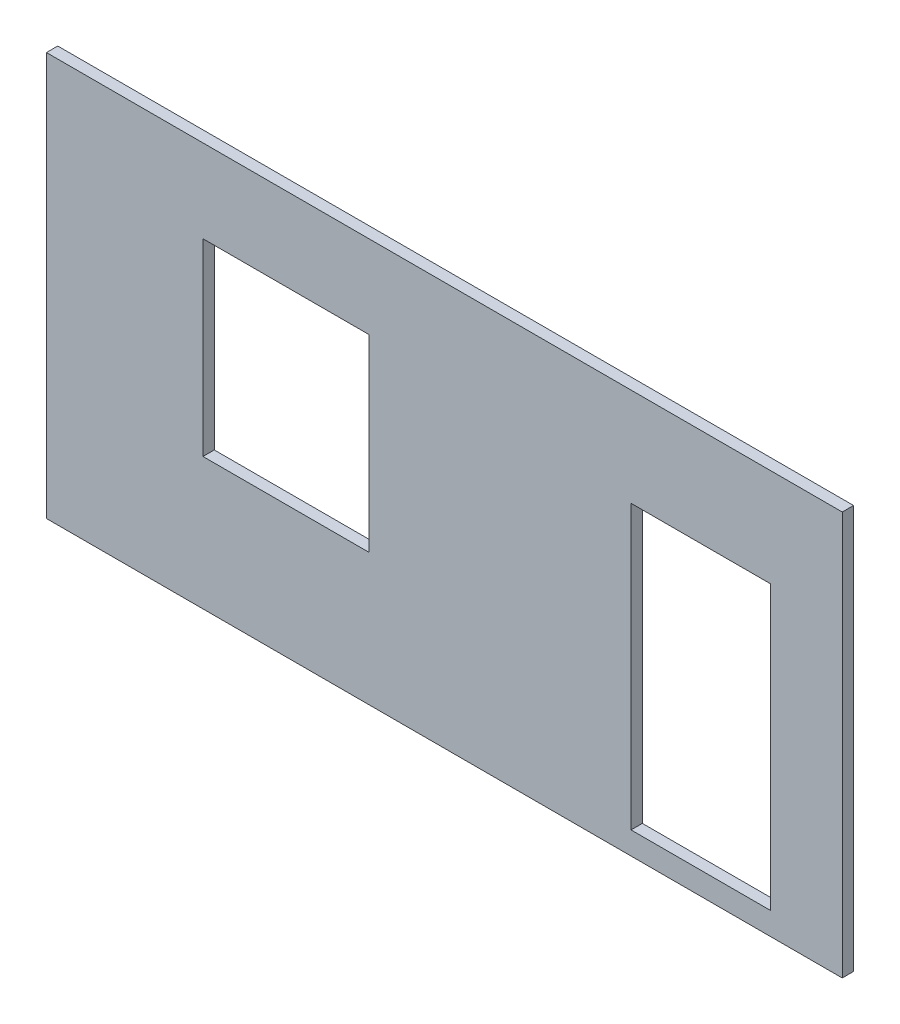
ISO-10303-21;
HEADER;
FILE_DESCRIPTION(('STEP AP214'),'2;1');
FILE_NAME('part.step','',(''),(''),'','','');
FILE_SCHEMA(('AUTOMOTIVE_DESIGN { 1 0 10303 214 1 1 1 1 }'));
ENDSEC;
DATA;
#1=APPLICATION_CONTEXT('core data for automotive mechanical design processes');
#2=APPLICATION_PROTOCOL_DEFINITION('international standard','automotive_design',2000,#1);
#3=PRODUCT_CONTEXT('',#1,'mechanical');
#4=PRODUCT('Part','Part','',(#3));
#5=PRODUCT_RELATED_PRODUCT_CATEGORY('part','',(#4));
#6=PRODUCT_DEFINITION_FORMATION('','',#4);
#7=PRODUCT_DEFINITION_CONTEXT('part definition',#1,'design');
#8=PRODUCT_DEFINITION('design','',#6,#7);
#9=PRODUCT_DEFINITION_SHAPE('','',#8);
#10=(LENGTH_UNIT() NAMED_UNIT(*) SI_UNIT(.MILLI.,.METRE.));
#11=(NAMED_UNIT(*) PLANE_ANGLE_UNIT() SI_UNIT($,.RADIAN.));
#12=(NAMED_UNIT(*) SI_UNIT($,.STERADIAN.) SOLID_ANGLE_UNIT());
#13=UNCERTAINTY_MEASURE_WITH_UNIT(LENGTH_MEASURE(1.E-05),#10,'distance_accuracy_value','');
#14=(GEOMETRIC_REPRESENTATION_CONTEXT(3) GLOBAL_UNCERTAINTY_ASSIGNED_CONTEXT((#13)) GLOBAL_UNIT_ASSIGNED_CONTEXT((#10,
#11,#12)) REPRESENTATION_CONTEXT('',''));
#15=CARTESIAN_POINT('',(0.,0.,0.));
#16=DIRECTION('',(0.,0.,1.));
#17=DIRECTION('',(1.,0.,0.));
#18=AXIS2_PLACEMENT_3D('',#15,#16,#17);
#19=CARTESIAN_POINT('',(0.,0.,3.));
#20=DIRECTION('',(1.,0.,0.));
#21=DIRECTION('',(0.,0.,-1.));
#22=AXIS2_PLACEMENT_3D('',#19,#20,#21);
#23=PLANE('',#22);
#24=DIRECTION('',(0.,-1.,0.));
#25=VECTOR('',#24,1.);
#26=CARTESIAN_POINT('',(0.,0.,0.));
#27=LINE('',#26,#25);
#28=CARTESIAN_POINT('',(0.,107.,0.));
#29=VERTEX_POINT('',#28);
#30=CARTESIAN_POINT('',(0.,0.,0.));
#31=VERTEX_POINT('',#30);
#32=EDGE_CURVE('E181',#29,#31,#27,.T.);
#33=ORIENTED_EDGE('',*,*,#32,.T.);
#34=DIRECTION('',(0.,0.,-1.));
#35=VECTOR('',#34,1.);
#36=CARTESIAN_POINT('',(0.,0.,3.));
#37=LINE('',#36,#35);
#38=CARTESIAN_POINT('',(0.,0.,3.));
#39=VERTEX_POINT('',#38);
#40=EDGE_CURVE('E11',#39,#31,#37,.T.);
#41=ORIENTED_EDGE('',*,*,#40,.F.);
#42=DIRECTION('',(0.,-1.,0.));
#43=VECTOR('',#42,1.);
#44=CARTESIAN_POINT('',(0.,0.,3.));
#45=LINE('',#44,#43);
#46=CARTESIAN_POINT('',(0.,107.,3.));
#47=VERTEX_POINT('',#46);
#48=EDGE_CURVE('E188',#47,#39,#45,.T.);
#49=ORIENTED_EDGE('',*,*,#48,.F.);
#50=DIRECTION('',(0.,0.,-1.));
#51=VECTOR('',#50,1.);
#52=CARTESIAN_POINT('',(0.,107.,3.));
#53=LINE('',#52,#51);
#54=EDGE_CURVE('E198',#47,#29,#53,.T.);
#55=ORIENTED_EDGE('',*,*,#54,.T.);
#56=EDGE_LOOP('',(#33,#41,#49,#55));
#57=FACE_BOUND('',#56,.T.);
#58=ADVANCED_FACE('F31',(#57),#23,.F.);
#59=CARTESIAN_POINT('',(0.,0.,3.));
#60=DIRECTION('',(0.,1.,0.));
#61=DIRECTION('',(0.,0.,1.));
#62=AXIS2_PLACEMENT_3D('',#59,#60,#61);
#63=PLANE('',#62);
#64=DIRECTION('',(1.,0.,0.));
#65=VECTOR('',#64,1.);
#66=CARTESIAN_POINT('',(0.,0.,0.));
#67=LINE('',#66,#65);
#68=CARTESIAN_POINT('',(211.,0.,0.));
#69=VERTEX_POINT('',#68);
#70=EDGE_CURVE('E201',#31,#69,#67,.T.);
#71=ORIENTED_EDGE('',*,*,#70,.T.);
#72=DIRECTION('',(0.,0.,-1.));
#73=VECTOR('',#72,1.);
#74=CARTESIAN_POINT('',(211.,0.,3.));
#75=LINE('',#74,#73);
#76=CARTESIAN_POINT('',(211.,0.,3.));
#77=VERTEX_POINT('',#76);
#78=EDGE_CURVE('E38',#77,#69,#75,.T.);
#79=ORIENTED_EDGE('',*,*,#78,.F.);
#80=DIRECTION('',(1.,0.,0.));
#81=VECTOR('',#80,1.);
#82=CARTESIAN_POINT('',(0.,0.,3.));
#83=LINE('',#82,#81);
#84=EDGE_CURVE('E191',#39,#77,#83,.T.);
#85=ORIENTED_EDGE('',*,*,#84,.F.);
#86=ORIENTED_EDGE('',*,*,#40,.T.);
#87=EDGE_LOOP('',(#71,#79,#85,#86));
#88=FACE_BOUND('',#87,.T.);
#89=ADVANCED_FACE('F230',(#88),#63,.F.);
#90=CARTESIAN_POINT('',(211.,0.,3.));
#91=DIRECTION('',(-1.,0.,0.));
#92=DIRECTION('',(0.,0.,1.));
#93=AXIS2_PLACEMENT_3D('',#90,#91,#92);
#94=PLANE('',#93);
#95=DIRECTION('',(0.,1.,0.));
#96=VECTOR('',#95,1.);
#97=CARTESIAN_POINT('',(211.,0.,0.));
#98=LINE('',#97,#96);
#99=CARTESIAN_POINT('',(211.,107.,0.));
#100=VERTEX_POINT('',#99);
#101=EDGE_CURVE('E203',#69,#100,#98,.T.);
#102=ORIENTED_EDGE('',*,*,#101,.T.);
#103=DIRECTION('',(0.,0.,-1.));
#104=VECTOR('',#103,1.);
#105=CARTESIAN_POINT('',(211.,107.,3.));
#106=LINE('',#105,#104);
#107=CARTESIAN_POINT('',(211.,107.,3.));
#108=VERTEX_POINT('',#107);
#109=EDGE_CURVE('E208',#108,#100,#106,.T.);
#110=ORIENTED_EDGE('',*,*,#109,.F.);
#111=DIRECTION('',(0.,1.,0.));
#112=VECTOR('',#111,1.);
#113=CARTESIAN_POINT('',(211.,0.,3.));
#114=LINE('',#113,#112);
#115=EDGE_CURVE('E194',#77,#108,#114,.T.);
#116=ORIENTED_EDGE('',*,*,#115,.F.);
#117=ORIENTED_EDGE('',*,*,#78,.T.);
#118=EDGE_LOOP('',(#102,#110,#116,#117));
#119=FACE_BOUND('',#118,.T.);
#120=ADVANCED_FACE('F215',(#119),#94,.F.);
#121=CARTESIAN_POINT('',(0.,107.,3.));
#122=DIRECTION('',(0.,-1.,0.));
#123=DIRECTION('',(0.,0.,-1.));
#124=AXIS2_PLACEMENT_3D('',#121,#122,#123);
#125=PLANE('',#124);
#126=DIRECTION('',(-1.,0.,0.));
#127=VECTOR('',#126,1.);
#128=CARTESIAN_POINT('',(0.,107.,0.));
#129=LINE('',#128,#127);
#130=EDGE_CURVE('E192',#100,#29,#129,.T.);
#131=ORIENTED_EDGE('',*,*,#130,.T.);
#132=ORIENTED_EDGE('',*,*,#54,.F.);
#133=DIRECTION('',(-1.,0.,0.));
#134=VECTOR('',#133,1.);
#135=CARTESIAN_POINT('',(0.,107.,3.));
#136=LINE('',#135,#134);
#137=EDGE_CURVE('E196',#108,#47,#136,.T.);
#138=ORIENTED_EDGE('',*,*,#137,.F.);
#139=ORIENTED_EDGE('',*,*,#109,.T.);
#140=EDGE_LOOP('',(#131,#132,#138,#139));
#141=FACE_BOUND('',#140,.T.);
#142=ADVANCED_FACE('F223',(#141),#125,.F.);
#143=CARTESIAN_POINT('',(0.,107.,3.));
#144=DIRECTION('',(0.,0.,-1.));
#145=DIRECTION('',(-1.,0.,0.));
#146=AXIS2_PLACEMENT_3D('',#143,#144,#145);
#147=PLANE('',#146);
#148=DIRECTION('',(1.,0.,0.));
#149=VECTOR('',#148,1.);
#150=CARTESIAN_POINT('',(155.,6.,3.));
#151=LINE('',#150,#149);
#152=CARTESIAN_POINT('',(155.,6.00000000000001,3.));
#153=VERTEX_POINT('',#152);
#154=CARTESIAN_POINT('',(192.,6.,3.));
#155=VERTEX_POINT('',#154);
#156=EDGE_CURVE('E146',#153,#155,#151,.T.);
#157=ORIENTED_EDGE('',*,*,#156,.F.);
#158=DIRECTION('',(0.,-1.,0.));
#159=VECTOR('',#158,1.);
#160=CARTESIAN_POINT('',(155.,6.,3.));
#161=LINE('',#160,#159);
#162=CARTESIAN_POINT('',(155.,81.,3.));
#163=VERTEX_POINT('',#162);
#164=EDGE_CURVE('E45',#163,#153,#161,.T.);
#165=ORIENTED_EDGE('',*,*,#164,.F.);
#166=DIRECTION('',(-1.,0.,0.));
#167=VECTOR('',#166,1.);
#168=CARTESIAN_POINT('',(155.,81.,3.));
#169=LINE('',#168,#167);
#170=CARTESIAN_POINT('',(192.,81.,3.));
#171=VERTEX_POINT('',#170);
#172=EDGE_CURVE('E137',#171,#163,#169,.T.);
#173=ORIENTED_EDGE('',*,*,#172,.F.);
#174=DIRECTION('',(0.,1.,0.));
#175=VECTOR('',#174,1.);
#176=CARTESIAN_POINT('',(192.,6.,3.));
#177=LINE('',#176,#175);
#178=EDGE_CURVE('E140',#155,#171,#177,.T.);
#179=ORIENTED_EDGE('',*,*,#178,.F.);
#180=EDGE_LOOP('',(#157,#165,#173,#179));
#181=FACE_BOUND('',#180,.T.);
#182=DIRECTION('',(1.,0.,0.));
#183=VECTOR('',#182,1.);
#184=CARTESIAN_POINT('',(41.5,35.,3.));
#185=LINE('',#184,#183);
#186=CARTESIAN_POINT('',(41.5,35.,3.));
#187=VERTEX_POINT('',#186);
#188=CARTESIAN_POINT('',(85.5,35.,3.));
#189=VERTEX_POINT('',#188);
#190=EDGE_CURVE('E171',#187,#189,#185,.T.);
#191=ORIENTED_EDGE('',*,*,#190,.F.);
#192=DIRECTION('',(0.,-1.,0.));
#193=VECTOR('',#192,1.);
#194=CARTESIAN_POINT('',(41.5,35.,3.));
#195=LINE('',#194,#193);
#196=CARTESIAN_POINT('',(41.5,85.,3.));
#197=VERTEX_POINT('',#196);
#198=EDGE_CURVE('E152',#197,#187,#195,.T.);
#199=ORIENTED_EDGE('',*,*,#198,.F.);
#200=DIRECTION('',(-1.,0.,0.));
#201=VECTOR('',#200,1.);
#202=CARTESIAN_POINT('',(41.5,85.,3.));
#203=LINE('',#202,#201);
#204=CARTESIAN_POINT('',(85.5,85.,3.));
#205=VERTEX_POINT('',#204);
#206=EDGE_CURVE('E160',#205,#197,#203,.T.);
#207=ORIENTED_EDGE('',*,*,#206,.F.);
#208=DIRECTION('',(0.,1.,0.));
#209=VECTOR('',#208,1.);
#210=CARTESIAN_POINT('',(85.5,35.,3.));
#211=LINE('',#210,#209);
#212=EDGE_CURVE('E174',#189,#205,#211,.T.);
#213=ORIENTED_EDGE('',*,*,#212,.F.);
#214=EDGE_LOOP('',(#191,#199,#207,#213));
#215=FACE_BOUND('',#214,.T.);
#216=ORIENTED_EDGE('',*,*,#48,.T.);
#217=ORIENTED_EDGE('',*,*,#84,.T.);
#218=ORIENTED_EDGE('',*,*,#115,.T.);
#219=ORIENTED_EDGE('',*,*,#137,.T.);
#220=EDGE_LOOP('',(#216,#217,#218,#219));
#221=FACE_BOUND('',#220,.T.);
#222=ADVANCED_FACE('F229',(#181,#215,#221),#147,.F.);
#223=CARTESIAN_POINT('',(0.,107.,0.));
#224=DIRECTION('',(0.,0.,-1.));
#225=DIRECTION('',(-1.,0.,0.));
#226=AXIS2_PLACEMENT_3D('',#223,#224,#225);
#227=PLANE('',#226);
#228=DIRECTION('',(0.,-1.,0.));
#229=VECTOR('',#228,1.);
#230=CARTESIAN_POINT('',(155.,6.,0.));
#231=LINE('',#230,#229);
#232=CARTESIAN_POINT('',(155.,81.,0.));
#233=VERTEX_POINT('',#232);
#234=CARTESIAN_POINT('',(155.,6.,0.));
#235=VERTEX_POINT('',#234);
#236=EDGE_CURVE('E121',#233,#235,#231,.T.);
#237=ORIENTED_EDGE('',*,*,#236,.T.);
#238=DIRECTION('',(1.,0.,0.));
#239=VECTOR('',#238,1.);
#240=CARTESIAN_POINT('',(155.,6.,0.));
#241=LINE('',#240,#239);
#242=CARTESIAN_POINT('',(192.,6.00000000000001,0.));
#243=VERTEX_POINT('',#242);
#244=EDGE_CURVE('E130',#235,#243,#241,.T.);
#245=ORIENTED_EDGE('',*,*,#244,.T.);
#246=DIRECTION('',(0.,1.,0.));
#247=VECTOR('',#246,1.);
#248=CARTESIAN_POINT('',(192.,6.,0.));
#249=LINE('',#248,#247);
#250=CARTESIAN_POINT('',(192.,81.,0.));
#251=VERTEX_POINT('',#250);
#252=EDGE_CURVE('E53',#243,#251,#249,.T.);
#253=ORIENTED_EDGE('',*,*,#252,.T.);
#254=DIRECTION('',(-1.,0.,0.));
#255=VECTOR('',#254,1.);
#256=CARTESIAN_POINT('',(155.,81.,0.));
#257=LINE('',#256,#255);
#258=EDGE_CURVE('E127',#251,#233,#257,.T.);
#259=ORIENTED_EDGE('',*,*,#258,.T.);
#260=EDGE_LOOP('',(#237,#245,#253,#259));
#261=FACE_BOUND('',#260,.T.);
#262=DIRECTION('',(0.,-1.,0.));
#263=VECTOR('',#262,1.);
#264=CARTESIAN_POINT('',(41.5,35.,0.));
#265=LINE('',#264,#263);
#266=CARTESIAN_POINT('',(41.5,85.,0.));
#267=VERTEX_POINT('',#266);
#268=CARTESIAN_POINT('',(41.5,35.,0.));
#269=VERTEX_POINT('',#268);
#270=EDGE_CURVE('E156',#267,#269,#265,.T.);
#271=ORIENTED_EDGE('',*,*,#270,.T.);
#272=DIRECTION('',(1.,0.,0.));
#273=VECTOR('',#272,1.);
#274=CARTESIAN_POINT('',(41.5,35.,0.));
#275=LINE('',#274,#273);
#276=CARTESIAN_POINT('',(85.5,35.,0.));
#277=VERTEX_POINT('',#276);
#278=EDGE_CURVE('E159',#269,#277,#275,.T.);
#279=ORIENTED_EDGE('',*,*,#278,.T.);
#280=DIRECTION('',(0.,1.,0.));
#281=VECTOR('',#280,1.);
#282=CARTESIAN_POINT('',(85.5,35.,0.));
#283=LINE('',#282,#281);
#284=CARTESIAN_POINT('',(85.5,85.,0.));
#285=VERTEX_POINT('',#284);
#286=EDGE_CURVE('E163',#277,#285,#283,.T.);
#287=ORIENTED_EDGE('',*,*,#286,.T.);
#288=DIRECTION('',(-1.,0.,0.));
#289=VECTOR('',#288,1.);
#290=CARTESIAN_POINT('',(41.5,85.,0.));
#291=LINE('',#290,#289);
#292=EDGE_CURVE('E166',#285,#267,#291,.T.);
#293=ORIENTED_EDGE('',*,*,#292,.T.);
#294=EDGE_LOOP('',(#271,#279,#287,#293));
#295=FACE_BOUND('',#294,.T.);
#296=ORIENTED_EDGE('',*,*,#32,.F.);
#297=ORIENTED_EDGE('',*,*,#130,.F.);
#298=ORIENTED_EDGE('',*,*,#101,.F.);
#299=ORIENTED_EDGE('',*,*,#70,.F.);
#300=EDGE_LOOP('',(#296,#297,#298,#299));
#301=FACE_BOUND('',#300,.T.);
#302=ADVANCED_FACE('F134',(#261,#295,#301),#227,.T.);
#303=CARTESIAN_POINT('',(41.5,35.,0.));
#304=DIRECTION('',(-1.,0.,0.));
#305=DIRECTION('',(0.,0.,1.));
#306=AXIS2_PLACEMENT_3D('',#303,#304,#305);
#307=PLANE('',#306);
#308=ORIENTED_EDGE('',*,*,#198,.T.);
#309=DIRECTION('',(0.,0.,1.));
#310=VECTOR('',#309,1.);
#311=CARTESIAN_POINT('',(41.5,35.,0.));
#312=LINE('',#311,#310);
#313=EDGE_CURVE('E169',#269,#187,#312,.T.);
#314=ORIENTED_EDGE('',*,*,#313,.F.);
#315=ORIENTED_EDGE('',*,*,#270,.F.);
#316=DIRECTION('',(0.,0.,1.));
#317=VECTOR('',#316,1.);
#318=CARTESIAN_POINT('',(41.5,85.,0.));
#319=LINE('',#318,#317);
#320=EDGE_CURVE('E179',#267,#197,#319,.T.);
#321=ORIENTED_EDGE('',*,*,#320,.T.);
#322=EDGE_LOOP('',(#308,#314,#315,#321));
#323=FACE_BOUND('',#322,.T.);
#324=ADVANCED_FACE('F242',(#323),#307,.F.);
#325=CARTESIAN_POINT('',(41.5,85.,0.));
#326=DIRECTION('',(0.,1.,0.));
#327=DIRECTION('',(0.,0.,1.));
#328=AXIS2_PLACEMENT_3D('',#325,#326,#327);
#329=PLANE('',#328);
#330=ORIENTED_EDGE('',*,*,#206,.T.);
#331=ORIENTED_EDGE('',*,*,#320,.F.);
#332=ORIENTED_EDGE('',*,*,#292,.F.);
#333=DIRECTION('',(0.,0.,1.));
#334=VECTOR('',#333,1.);
#335=CARTESIAN_POINT('',(85.5,85.,0.));
#336=LINE('',#335,#334);
#337=EDGE_CURVE('E182',#285,#205,#336,.T.);
#338=ORIENTED_EDGE('',*,*,#337,.T.);
#339=EDGE_LOOP('',(#330,#331,#332,#338));
#340=FACE_BOUND('',#339,.T.);
#341=ADVANCED_FACE('F248',(#340),#329,.F.);
#342=CARTESIAN_POINT('',(85.5,35.,0.));
#343=DIRECTION('',(1.,0.,0.));
#344=DIRECTION('',(0.,0.,-1.));
#345=AXIS2_PLACEMENT_3D('',#342,#343,#344);
#346=PLANE('',#345);
#347=ORIENTED_EDGE('',*,*,#212,.T.);
#348=ORIENTED_EDGE('',*,*,#337,.F.);
#349=ORIENTED_EDGE('',*,*,#286,.F.);
#350=DIRECTION('',(0.,0.,1.));
#351=VECTOR('',#350,1.);
#352=CARTESIAN_POINT('',(85.5,35.,0.));
#353=LINE('',#352,#351);
#354=EDGE_CURVE('E184',#277,#189,#353,.T.);
#355=ORIENTED_EDGE('',*,*,#354,.T.);
#356=EDGE_LOOP('',(#347,#348,#349,#355));
#357=FACE_BOUND('',#356,.T.);
#358=ADVANCED_FACE('F253',(#357),#346,.F.);
#359=CARTESIAN_POINT('',(41.5,35.,0.));
#360=DIRECTION('',(0.,-1.,0.));
#361=DIRECTION('',(0.,0.,-1.));
#362=AXIS2_PLACEMENT_3D('',#359,#360,#361);
#363=PLANE('',#362);
#364=ORIENTED_EDGE('',*,*,#190,.T.);
#365=ORIENTED_EDGE('',*,*,#354,.F.);
#366=ORIENTED_EDGE('',*,*,#278,.F.);
#367=ORIENTED_EDGE('',*,*,#313,.T.);
#368=EDGE_LOOP('',(#364,#365,#366,#367));
#369=FACE_BOUND('',#368,.T.);
#370=ADVANCED_FACE('F250',(#369),#363,.F.);
#371=CARTESIAN_POINT('',(155.,6.,0.));
#372=DIRECTION('',(-1.,0.,0.));
#373=DIRECTION('',(0.,0.,1.));
#374=AXIS2_PLACEMENT_3D('',#371,#372,#373);
#375=PLANE('',#374);
#376=ORIENTED_EDGE('',*,*,#164,.T.);
#377=DIRECTION('',(0.,0.,1.));
#378=VECTOR('',#377,1.);
#379=CARTESIAN_POINT('',(155.,6.,0.));
#380=LINE('',#379,#378);
#381=EDGE_CURVE('E117',#235,#153,#380,.T.);
#382=ORIENTED_EDGE('',*,*,#381,.F.);
#383=ORIENTED_EDGE('',*,*,#236,.F.);
#384=DIRECTION('',(0.,0.,1.));
#385=VECTOR('',#384,1.);
#386=CARTESIAN_POINT('',(155.,81.,0.));
#387=LINE('',#386,#385);
#388=EDGE_CURVE('E150',#233,#163,#387,.T.);
#389=ORIENTED_EDGE('',*,*,#388,.T.);
#390=EDGE_LOOP('',(#376,#382,#383,#389));
#391=FACE_BOUND('',#390,.T.);
#392=ADVANCED_FACE('F119',(#391),#375,.F.);
#393=CARTESIAN_POINT('',(155.,81.,0.));
#394=DIRECTION('',(0.,1.,0.));
#395=DIRECTION('',(-1.,0.,0.));
#396=AXIS2_PLACEMENT_3D('',#393,#394,#395);
#397=PLANE('',#396);
#398=ORIENTED_EDGE('',*,*,#172,.T.);
#399=ORIENTED_EDGE('',*,*,#388,.F.);
#400=ORIENTED_EDGE('',*,*,#258,.F.);
#401=DIRECTION('',(0.,0.,1.));
#402=VECTOR('',#401,1.);
#403=CARTESIAN_POINT('',(192.,81.,0.));
#404=LINE('',#403,#402);
#405=EDGE_CURVE('E153',#251,#171,#404,.T.);
#406=ORIENTED_EDGE('',*,*,#405,.T.);
#407=EDGE_LOOP('',(#398,#399,#400,#406));
#408=FACE_BOUND('',#407,.T.);
#409=ADVANCED_FACE('F263',(#408),#397,.F.);
#410=CARTESIAN_POINT('',(192.,6.,0.));
#411=DIRECTION('',(1.,0.,0.));
#412=DIRECTION('',(0.,0.,-1.));
#413=AXIS2_PLACEMENT_3D('',#410,#411,#412);
#414=PLANE('',#413);
#415=ORIENTED_EDGE('',*,*,#178,.T.);
#416=ORIENTED_EDGE('',*,*,#405,.F.);
#417=ORIENTED_EDGE('',*,*,#252,.F.);
#418=DIRECTION('',(0.,0.,1.));
#419=VECTOR('',#418,1.);
#420=CARTESIAN_POINT('',(192.,6.,0.));
#421=LINE('',#420,#419);
#422=EDGE_CURVE('E126',#243,#155,#421,.T.);
#423=ORIENTED_EDGE('',*,*,#422,.T.);
#424=EDGE_LOOP('',(#415,#416,#417,#423));
#425=FACE_BOUND('',#424,.T.);
#426=ADVANCED_FACE('F266',(#425),#414,.F.);
#427=CARTESIAN_POINT('',(155.,6.,0.));
#428=DIRECTION('',(0.,-1.,0.));
#429=DIRECTION('',(0.,0.,-1.));
#430=AXIS2_PLACEMENT_3D('',#427,#428,#429);
#431=PLANE('',#430);
#432=ORIENTED_EDGE('',*,*,#156,.T.);
#433=ORIENTED_EDGE('',*,*,#422,.F.);
#434=ORIENTED_EDGE('',*,*,#244,.F.);
#435=ORIENTED_EDGE('',*,*,#381,.T.);
#436=EDGE_LOOP('',(#432,#433,#434,#435));
#437=FACE_BOUND('',#436,.T.);
#438=ADVANCED_FACE('F131',(#437),#431,.F.);
#439=CLOSED_SHELL('',(#58,#89,#120,#142,#222,#302,#324,#341,#358,#370,#392,#409,#426,#438));
#440=MANIFOLD_SOLID_BREP('B2',#439);
#441=ADVANCED_BREP_SHAPE_REPRESENTATION('',(#18,#440),#14);
#442=SHAPE_DEFINITION_REPRESENTATION(#9,#441);
ENDSEC;
END-ISO-10303-21;
